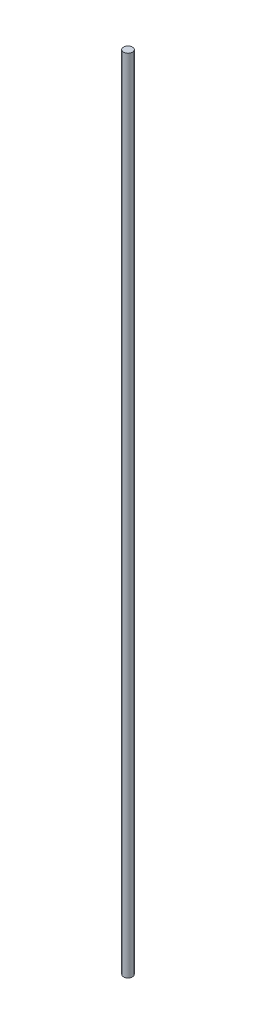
ISO-10303-21;
HEADER;
FILE_DESCRIPTION(('STEP AP214'),'2;1');
FILE_NAME('part.step','',(''),(''),'','','');
FILE_SCHEMA(('AUTOMOTIVE_DESIGN { 1 0 10303 214 1 1 1 1 }'));
ENDSEC;
DATA;
#1=APPLICATION_CONTEXT('core data for automotive mechanical design processes');
#2=APPLICATION_PROTOCOL_DEFINITION('international standard','automotive_design',2000,#1);
#3=PRODUCT_CONTEXT('',#1,'mechanical');
#4=PRODUCT('Part','Part','',(#3));
#5=PRODUCT_RELATED_PRODUCT_CATEGORY('part','',(#4));
#6=PRODUCT_DEFINITION_FORMATION('','',#4);
#7=PRODUCT_DEFINITION_CONTEXT('part definition',#1,'design');
#8=PRODUCT_DEFINITION('design','',#6,#7);
#9=PRODUCT_DEFINITION_SHAPE('','',#8);
#10=(LENGTH_UNIT() NAMED_UNIT(*) SI_UNIT(.MILLI.,.METRE.));
#11=(NAMED_UNIT(*) PLANE_ANGLE_UNIT() SI_UNIT($,.RADIAN.));
#12=(NAMED_UNIT(*) SI_UNIT($,.STERADIAN.) SOLID_ANGLE_UNIT());
#13=UNCERTAINTY_MEASURE_WITH_UNIT(LENGTH_MEASURE(1.E-05),#10,'distance_accuracy_value','');
#14=(GEOMETRIC_REPRESENTATION_CONTEXT(3) GLOBAL_UNCERTAINTY_ASSIGNED_CONTEXT((#13)) GLOBAL_UNIT_ASSIGNED_CONTEXT((#10,
#11,#12)) REPRESENTATION_CONTEXT('',''));
#15=CARTESIAN_POINT('',(0.,0.,0.));
#16=DIRECTION('',(0.,0.,1.));
#17=DIRECTION('',(1.,0.,0.));
#18=AXIS2_PLACEMENT_3D('',#15,#16,#17);
#19=CARTESIAN_POINT('',(0.,571.5,0.));
#20=DIRECTION('',(0.,-1.,0.));
#21=DIRECTION('',(0.,0.,-1.));
#22=AXIS2_PLACEMENT_3D('',#19,#20,#21);
#23=CYLINDRICAL_SURFACE('',#22,6.35);
#24=CARTESIAN_POINT('',(0.,571.5,0.));
#25=DIRECTION('',(0.,1.,0.));
#26=DIRECTION('',(0.,0.,1.));
#27=AXIS2_PLACEMENT_3D('',#24,#25,#26);
#28=CIRCLE('',#27,6.35);
#29=CARTESIAN_POINT('',(0.,571.5,6.35));
#30=VERTEX_POINT('',#29);
#31=EDGE_CURVE('E10',#30,#30,#28,.T.);
#32=ORIENTED_EDGE('',*,*,#31,.F.);
#33=EDGE_LOOP('',(#32));
#34=FACE_BOUND('',#33,.T.);
#35=CARTESIAN_POINT('',(0.,-571.5,0.));
#36=DIRECTION('',(0.,1.,0.));
#37=DIRECTION('',(0.,0.,1.));
#38=AXIS2_PLACEMENT_3D('',#35,#36,#37);
#39=CIRCLE('',#38,6.35);
#40=CARTESIAN_POINT('',(0.,-571.5,6.35));
#41=VERTEX_POINT('',#40);
#42=EDGE_CURVE('E45',#41,#41,#39,.T.);
#43=ORIENTED_EDGE('',*,*,#42,.T.);
#44=EDGE_LOOP('',(#43));
#45=FACE_BOUND('',#44,.T.);
#46=ADVANCED_FACE('F39',(#34,#45),#23,.T.);
#47=CARTESIAN_POINT('',(0.,571.5,0.));
#48=DIRECTION('',(0.,1.,0.));
#49=DIRECTION('',(0.,0.,1.));
#50=AXIS2_PLACEMENT_3D('',#47,#48,#49);
#51=PLANE('',#50);
#52=ORIENTED_EDGE('',*,*,#31,.T.);
#53=EDGE_LOOP('',(#52));
#54=FACE_BOUND('',#53,.T.);
#55=ADVANCED_FACE('F53',(#54),#51,.T.);
#56=CARTESIAN_POINT('',(0.,-571.5,0.));
#57=DIRECTION('',(0.,1.,0.));
#58=DIRECTION('',(0.,0.,1.));
#59=AXIS2_PLACEMENT_3D('',#56,#57,#58);
#60=PLANE('',#59);
#61=ORIENTED_EDGE('',*,*,#42,.F.);
#62=EDGE_LOOP('',(#61));
#63=FACE_BOUND('',#62,.T.);
#64=ADVANCED_FACE('F55',(#63),#60,.F.);
#65=CLOSED_SHELL('',(#46,#55,#64));
#66=MANIFOLD_SOLID_BREP('B2',#65);
#67=ADVANCED_BREP_SHAPE_REPRESENTATION('',(#18,#66),#14);
#68=SHAPE_DEFINITION_REPRESENTATION(#9,#67);
ENDSEC;
END-ISO-10303-21;
